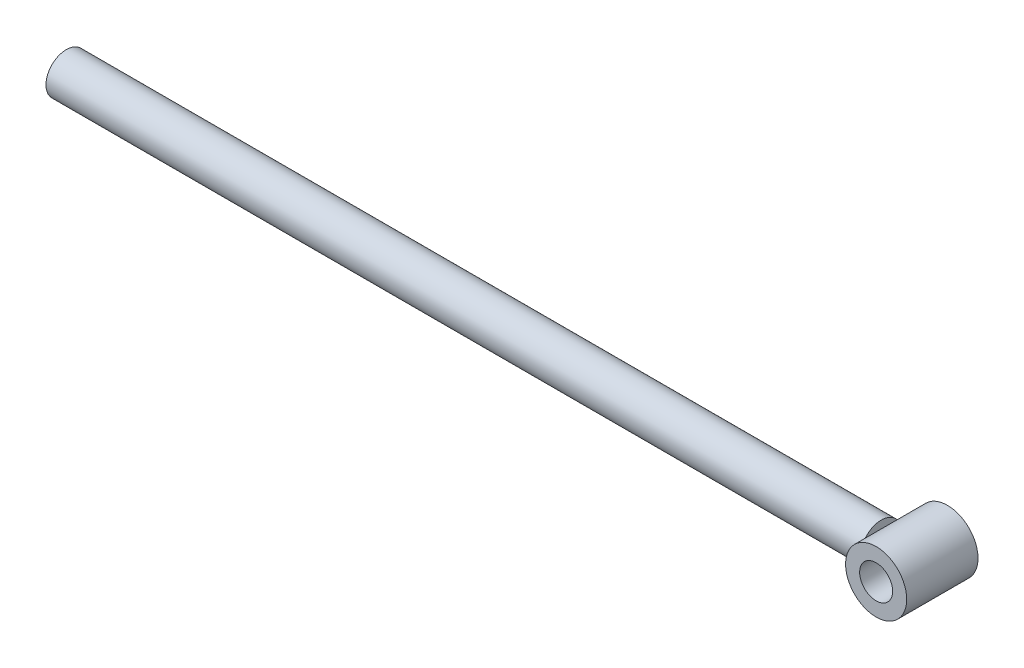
ISO-10303-21;
HEADER;
FILE_DESCRIPTION(('STEP AP214'),'2;1');
FILE_NAME('part.step','',(''),(''),'','','');
FILE_SCHEMA(('AUTOMOTIVE_DESIGN { 1 0 10303 214 1 1 1 1 }'));
ENDSEC;
DATA;
#1=APPLICATION_CONTEXT('core data for automotive mechanical design processes');
#2=APPLICATION_PROTOCOL_DEFINITION('international standard','automotive_design',2000,#1);
#3=PRODUCT_CONTEXT('',#1,'mechanical');
#4=PRODUCT('Part','Part','',(#3));
#5=PRODUCT_RELATED_PRODUCT_CATEGORY('part','',(#4));
#6=PRODUCT_DEFINITION_FORMATION('','',#4);
#7=PRODUCT_DEFINITION_CONTEXT('part definition',#1,'design');
#8=PRODUCT_DEFINITION('design','',#6,#7);
#9=PRODUCT_DEFINITION_SHAPE('','',#8);
#10=(LENGTH_UNIT() NAMED_UNIT(*) SI_UNIT(.MILLI.,.METRE.));
#11=(NAMED_UNIT(*) PLANE_ANGLE_UNIT() SI_UNIT($,.RADIAN.));
#12=(NAMED_UNIT(*) SI_UNIT($,.STERADIAN.) SOLID_ANGLE_UNIT());
#13=UNCERTAINTY_MEASURE_WITH_UNIT(LENGTH_MEASURE(1.E-05),#10,'distance_accuracy_value','');
#14=(GEOMETRIC_REPRESENTATION_CONTEXT(3) GLOBAL_UNCERTAINTY_ASSIGNED_CONTEXT((#13)) GLOBAL_UNIT_ASSIGNED_CONTEXT((#10,
#11,#12)) REPRESENTATION_CONTEXT('',''));
#15=CARTESIAN_POINT('',(0.,0.,0.));
#16=DIRECTION('',(0.,0.,1.));
#17=DIRECTION('',(1.,0.,0.));
#18=AXIS2_PLACEMENT_3D('',#15,#16,#17);
#19=CARTESIAN_POINT('',(415.,0.,17.5));
#20=DIRECTION('',(0.,0.,1.));
#21=DIRECTION('',(1.,0.,0.));
#22=AXIS2_PLACEMENT_3D('',#19,#20,#21);
#23=PLANE('',#22);
#24=CARTESIAN_POINT('',(415.,0.,17.5));
#25=DIRECTION('',(0.,0.,1.));
#26=DIRECTION('',(1.,0.,0.));
#27=AXIS2_PLACEMENT_3D('',#24,#25,#26);
#28=CIRCLE('',#27,15.);
#29=CARTESIAN_POINT('',(430.,0.,17.5));
#30=VERTEX_POINT('',#29);
#31=EDGE_CURVE('E11',#30,#30,#28,.T.);
#32=ORIENTED_EDGE('',*,*,#31,.T.);
#33=EDGE_LOOP('',(#32));
#34=FACE_BOUND('',#33,.T.);
#35=CARTESIAN_POINT('',(415.,0.,17.5));
#36=DIRECTION('',(0.,0.,1.));
#37=DIRECTION('',(1.,0.,0.));
#38=AXIS2_PLACEMENT_3D('',#35,#36,#37);
#39=CIRCLE('',#38,8.09999999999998);
#40=CARTESIAN_POINT('',(423.1,0.,17.5));
#41=VERTEX_POINT('',#40);
#42=EDGE_CURVE('E48',#41,#41,#39,.T.);
#43=ORIENTED_EDGE('',*,*,#42,.F.);
#44=EDGE_LOOP('',(#43));
#45=FACE_BOUND('',#44,.T.);
#46=ADVANCED_FACE('F37',(#34,#45),#23,.T.);
#47=CARTESIAN_POINT('',(415.,0.,-17.5));
#48=DIRECTION('',(0.,0.,1.));
#49=DIRECTION('',(1.,0.,0.));
#50=AXIS2_PLACEMENT_3D('',#47,#48,#49);
#51=PLANE('',#50);
#52=CARTESIAN_POINT('',(415.,0.,-17.5));
#53=DIRECTION('',(0.,0.,1.));
#54=DIRECTION('',(1.,0.,0.));
#55=AXIS2_PLACEMENT_3D('',#52,#53,#54);
#56=CIRCLE('',#55,15.);
#57=CARTESIAN_POINT('',(430.,0.,-17.5));
#58=VERTEX_POINT('',#57);
#59=EDGE_CURVE('E44',#58,#58,#56,.T.);
#60=ORIENTED_EDGE('',*,*,#59,.F.);
#61=EDGE_LOOP('',(#60));
#62=FACE_BOUND('',#61,.T.);
#63=CARTESIAN_POINT('',(415.,0.,-17.5));
#64=DIRECTION('',(0.,0.,1.));
#65=DIRECTION('',(1.,0.,0.));
#66=AXIS2_PLACEMENT_3D('',#63,#64,#65);
#67=CIRCLE('',#66,8.09999999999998);
#68=CARTESIAN_POINT('',(423.1,0.,-17.5));
#69=VERTEX_POINT('',#68);
#70=EDGE_CURVE('E52',#69,#69,#67,.T.);
#71=ORIENTED_EDGE('',*,*,#70,.T.);
#72=EDGE_LOOP('',(#71));
#73=FACE_BOUND('',#72,.T.);
#74=ADVANCED_FACE('F58',(#62,#73),#51,.F.);
#75=CARTESIAN_POINT('',(415.,0.,17.5));
#76=DIRECTION('',(0.,0.,-1.));
#77=DIRECTION('',(-1.,0.,0.));
#78=AXIS2_PLACEMENT_3D('',#75,#76,#77);
#79=CYLINDRICAL_SURFACE('',#78,15.);
#80=ORIENTED_EDGE('',*,*,#31,.F.);
#81=EDGE_LOOP('',(#80));
#82=FACE_BOUND('',#81,.T.);
#83=ORIENTED_EDGE('',*,*,#59,.T.);
#84=EDGE_LOOP('',(#83));
#85=FACE_BOUND('',#84,.T.);
#86=ADVANCED_FACE('F39',(#82,#85),#79,.T.);
#87=CARTESIAN_POINT('',(415.,0.,17.5));
#88=DIRECTION('',(0.,0.,-1.));
#89=DIRECTION('',(-1.,0.,0.));
#90=AXIS2_PLACEMENT_3D('',#87,#88,#89);
#91=CYLINDRICAL_SURFACE('',#90,8.09999999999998);
#92=ORIENTED_EDGE('',*,*,#42,.T.);
#93=EDGE_LOOP('',(#92));
#94=FACE_BOUND('',#93,.T.);
#95=ORIENTED_EDGE('',*,*,#70,.F.);
#96=EDGE_LOOP('',(#95));
#97=FACE_BOUND('',#96,.T.);
#98=ADVANCED_FACE('F60',(#94,#97),#91,.F.);
#99=CLOSED_SHELL('',(#46,#74,#86,#98));
#100=MANIFOLD_SOLID_BREP('B2',#99);
#101=CARTESIAN_POINT('',(400.,0.,0.));
#102=DIRECTION('',(-1.,0.,0.));
#103=DIRECTION('',(0.,0.,1.));
#104=AXIS2_PLACEMENT_3D('',#101,#102,#103);
#105=CYLINDRICAL_SURFACE('',#104,10.);
#106=CARTESIAN_POINT('',(400.,0.,0.));
#107=DIRECTION('',(1.,0.,0.));
#108=DIRECTION('',(0.,0.,-1.));
#109=AXIS2_PLACEMENT_3D('',#106,#107,#108);
#110=CIRCLE('',#109,10.);
#111=CARTESIAN_POINT('',(400.,0.,-10.));
#112=VERTEX_POINT('',#111);
#113=EDGE_CURVE('E36',#112,#112,#110,.T.);
#114=ORIENTED_EDGE('',*,*,#113,.F.);
#115=EDGE_LOOP('',(#114));
#116=FACE_BOUND('',#115,.T.);
#117=CARTESIAN_POINT('',(0.,0.,0.));
#118=DIRECTION('',(1.,0.,0.));
#119=DIRECTION('',(0.,0.,-1.));
#120=AXIS2_PLACEMENT_3D('',#117,#118,#119);
#121=CIRCLE('',#120,10.);
#122=CARTESIAN_POINT('',(0.,0.,-10.));
#123=VERTEX_POINT('',#122);
#124=EDGE_CURVE('E105',#123,#123,#121,.T.);
#125=ORIENTED_EDGE('',*,*,#124,.T.);
#126=EDGE_LOOP('',(#125));
#127=FACE_BOUND('',#126,.T.);
#128=ADVANCED_FACE('F99',(#116,#127),#105,.T.);
#129=CARTESIAN_POINT('',(400.,0.,0.));
#130=DIRECTION('',(1.,0.,0.));
#131=DIRECTION('',(0.,0.,-1.));
#132=AXIS2_PLACEMENT_3D('',#129,#130,#131);
#133=PLANE('',#132);
#134=ORIENTED_EDGE('',*,*,#113,.T.);
#135=EDGE_LOOP('',(#134));
#136=FACE_BOUND('',#135,.T.);
#137=ADVANCED_FACE('F114',(#136),#133,.T.);
#138=CARTESIAN_POINT('',(0.,0.,0.));
#139=DIRECTION('',(1.,0.,0.));
#140=DIRECTION('',(0.,0.,-1.));
#141=AXIS2_PLACEMENT_3D('',#138,#139,#140);
#142=PLANE('',#141);
#143=ORIENTED_EDGE('',*,*,#124,.F.);
#144=EDGE_LOOP('',(#143));
#145=FACE_BOUND('',#144,.T.);
#146=ADVANCED_FACE('F112',(#145),#142,.F.);
#147=CLOSED_SHELL('',(#128,#137,#146));
#148=MANIFOLD_SOLID_BREP('B6',#147);
#149=ADVANCED_BREP_SHAPE_REPRESENTATION('',(#18,#100,#148),#14);
#150=SHAPE_DEFINITION_REPRESENTATION(#9,#149);
ENDSEC;
END-ISO-10303-21;
